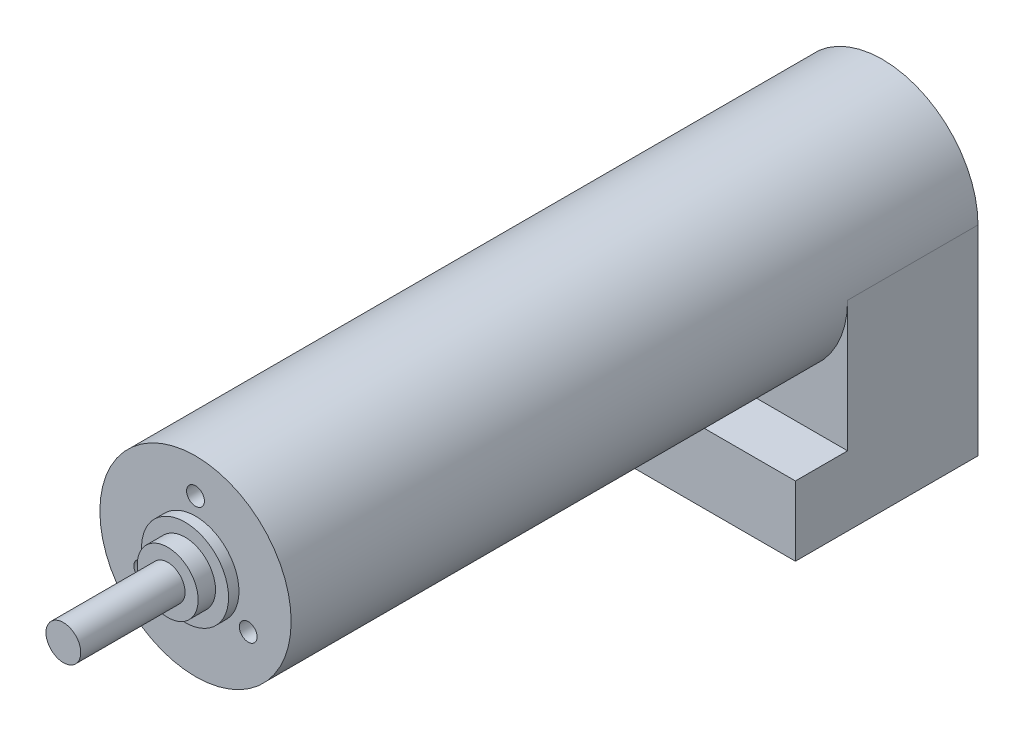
ISO-10303-21;
HEADER;
FILE_DESCRIPTION(('STEP AP214'),'2;1');
FILE_NAME('part.step','',(''),(''),'','','');
FILE_SCHEMA(('AUTOMOTIVE_DESIGN { 1 0 10303 214 1 1 1 1 }'));
ENDSEC;
DATA;
#1=APPLICATION_CONTEXT('core data for automotive mechanical design processes');
#2=APPLICATION_PROTOCOL_DEFINITION('international standard','automotive_design',2000,#1);
#3=PRODUCT_CONTEXT('',#1,'mechanical');
#4=PRODUCT('Part','Part','',(#3));
#5=PRODUCT_RELATED_PRODUCT_CATEGORY('part','',(#4));
#6=PRODUCT_DEFINITION_FORMATION('','',#4);
#7=PRODUCT_DEFINITION_CONTEXT('part definition',#1,'design');
#8=PRODUCT_DEFINITION('design','',#6,#7);
#9=PRODUCT_DEFINITION_SHAPE('','',#8);
#10=(LENGTH_UNIT() NAMED_UNIT(*) SI_UNIT(.MILLI.,.METRE.));
#11=(NAMED_UNIT(*) PLANE_ANGLE_UNIT() SI_UNIT($,.RADIAN.));
#12=(NAMED_UNIT(*) SI_UNIT($,.STERADIAN.) SOLID_ANGLE_UNIT());
#13=UNCERTAINTY_MEASURE_WITH_UNIT(LENGTH_MEASURE(1.E-05),#10,'distance_accuracy_value','');
#14=(GEOMETRIC_REPRESENTATION_CONTEXT(3) GLOBAL_UNCERTAINTY_ASSIGNED_CONTEXT((#13)) GLOBAL_UNIT_ASSIGNED_CONTEXT((#10,
#11,#12)) REPRESENTATION_CONTEXT('',''));
#15=CARTESIAN_POINT('',(0.,0.,0.));
#16=DIRECTION('',(0.,0.,1.));
#17=DIRECTION('',(1.,0.,0.));
#18=AXIS2_PLACEMENT_3D('',#15,#16,#17);
#19=CARTESIAN_POINT('',(0.,0.,64.));
#20=DIRECTION('',(0.,0.,-1.));
#21=DIRECTION('',(-1.,0.,0.));
#22=AXIS2_PLACEMENT_3D('',#19,#20,#21);
#23=CYLINDRICAL_SURFACE('',#22,11.);
#24=CARTESIAN_POINT('',(0.,0.,64.));
#25=DIRECTION('',(0.,0.,1.));
#26=DIRECTION('',(1.,0.,0.));
#27=AXIS2_PLACEMENT_3D('',#24,#25,#26);
#28=CIRCLE('',#27,11.);
#29=CARTESIAN_POINT('',(11.,0.,64.));
#30=VERTEX_POINT('',#29);
#31=EDGE_CURVE('E45',#30,#30,#28,.T.);
#32=ORIENTED_EDGE('',*,*,#31,.F.);
#33=EDGE_LOOP('',(#32));
#34=FACE_BOUND('',#33,.T.);
#35=CARTESIAN_POINT('',(0.,0.,0.));
#36=DIRECTION('',(0.,0.,1.));
#37=DIRECTION('',(1.,0.,0.));
#38=AXIS2_PLACEMENT_3D('',#35,#36,#37);
#39=CIRCLE('',#38,11.);
#40=CARTESIAN_POINT('',(-11.,0.,0.));
#41=VERTEX_POINT('',#40);
#42=CARTESIAN_POINT('',(11.,0.,0.));
#43=VERTEX_POINT('',#42);
#44=EDGE_CURVE('E123',#41,#43,#39,.T.);
#45=ORIENTED_EDGE('',*,*,#44,.T.);
#46=DIRECTION('',(0.,0.,1.));
#47=VECTOR('',#46,1.);
#48=CARTESIAN_POINT('',(11.,0.,-15.));
#49=LINE('',#48,#47);
#50=CARTESIAN_POINT('',(11.,0.,-15.));
#51=VERTEX_POINT('',#50);
#52=EDGE_CURVE('E52',#51,#43,#49,.T.);
#53=ORIENTED_EDGE('',*,*,#52,.F.);
#54=CARTESIAN_POINT('',(0.,0.,-15.));
#55=DIRECTION('',(0.,0.,-1.));
#56=DIRECTION('',(-1.,0.,0.));
#57=AXIS2_PLACEMENT_3D('',#54,#55,#56);
#58=CIRCLE('',#57,11.);
#59=CARTESIAN_POINT('',(-11.,0.,-15.));
#60=VERTEX_POINT('',#59);
#61=EDGE_CURVE('E95',#60,#51,#58,.T.);
#62=ORIENTED_EDGE('',*,*,#61,.F.);
#63=DIRECTION('',(0.,0.,1.));
#64=VECTOR('',#63,1.);
#65=CARTESIAN_POINT('',(-11.,0.,-15.));
#66=LINE('',#65,#64);
#67=EDGE_CURVE('E112',#60,#41,#66,.T.);
#68=ORIENTED_EDGE('',*,*,#67,.T.);
#69=EDGE_LOOP('',(#45,#53,#62,#68));
#70=FACE_BOUND('',#69,.T.);
#71=ADVANCED_FACE('F38',(#34,#70),#23,.T.);
#72=CARTESIAN_POINT('',(0.,0.,64.));
#73=DIRECTION('',(0.,0.,1.));
#74=DIRECTION('',(1.,0.,0.));
#75=AXIS2_PLACEMENT_3D('',#72,#73,#74);
#76=PLANE('',#75);
#77=CARTESIAN_POINT('',(0.,0.,64.));
#78=DIRECTION('',(0.,0.,1.));
#79=DIRECTION('',(1.,0.,0.));
#80=AXIS2_PLACEMENT_3D('',#77,#78,#79);
#81=CIRCLE('',#80,5.);
#82=CARTESIAN_POINT('',(5.,0.,64.));
#83=VERTEX_POINT('',#82);
#84=EDGE_CURVE('E167',#83,#83,#81,.T.);
#85=ORIENTED_EDGE('',*,*,#84,.F.);
#86=EDGE_LOOP('',(#85));
#87=FACE_BOUND('',#86,.T.);
#88=CARTESIAN_POINT('',(0.,7.,64.));
#89=DIRECTION('',(0.,0.,1.));
#90=DIRECTION('',(1.,0.,0.));
#91=AXIS2_PLACEMENT_3D('',#88,#89,#90);
#92=CIRCLE('',#91,1.025);
#93=CARTESIAN_POINT('',(1.025,7.,64.));
#94=VERTEX_POINT('',#93);
#95=EDGE_CURVE('E163',#94,#94,#92,.T.);
#96=ORIENTED_EDGE('',*,*,#95,.F.);
#97=EDGE_LOOP('',(#96));
#98=FACE_BOUND('',#97,.T.);
#99=CARTESIAN_POINT('',(6.06217782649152,-3.49999999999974,64.));
#100=DIRECTION('',(0.,0.,1.));
#101=DIRECTION('',(1.,0.,0.));
#102=AXIS2_PLACEMENT_3D('',#99,#100,#101);
#103=CIRCLE('',#102,1.025);
#104=CARTESIAN_POINT('',(7.08717782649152,-3.49999999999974,64.));
#105=VERTEX_POINT('',#104);
#106=EDGE_CURVE('E157',#105,#105,#103,.T.);
#107=ORIENTED_EDGE('',*,*,#106,.F.);
#108=EDGE_LOOP('',(#107));
#109=FACE_BOUND('',#108,.T.);
#110=CARTESIAN_POINT('',(-6.06217782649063,-3.50000000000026,64.));
#111=DIRECTION('',(0.,0.,1.));
#112=DIRECTION('',(1.,0.,0.));
#113=AXIS2_PLACEMENT_3D('',#110,#111,#112);
#114=CIRCLE('',#113,1.025);
#115=CARTESIAN_POINT('',(-5.03717782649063,-3.50000000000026,64.));
#116=VERTEX_POINT('',#115);
#117=EDGE_CURVE('E151',#116,#116,#114,.T.);
#118=ORIENTED_EDGE('',*,*,#117,.F.);
#119=EDGE_LOOP('',(#118));
#120=FACE_BOUND('',#119,.T.);
#121=ORIENTED_EDGE('',*,*,#31,.T.);
#122=EDGE_LOOP('',(#121));
#123=FACE_BOUND('',#122,.T.);
#124=ADVANCED_FACE('F218',(#87,#98,#109,#120,#123),#76,.T.);
#125=CARTESIAN_POINT('',(11.,0.,-15.));
#126=DIRECTION('',(-1.,0.,0.));
#127=DIRECTION('',(0.,0.,1.));
#128=AXIS2_PLACEMENT_3D('',#125,#126,#127);
#129=PLANE('',#128);
#130=DIRECTION('',(0.,-1.,0.));
#131=VECTOR('',#130,1.);
#132=CARTESIAN_POINT('',(11.,0.,0.));
#133=LINE('',#132,#131);
#134=CARTESIAN_POINT('',(11.,-15.,0.));
#135=VERTEX_POINT('',#134);
#136=EDGE_CURVE('E116',#43,#135,#133,.T.);
#137=ORIENTED_EDGE('',*,*,#136,.T.);
#138=DIRECTION('',(0.,0.,-1.));
#139=VECTOR('',#138,1.);
#140=CARTESIAN_POINT('',(11.,-15.,6.));
#141=LINE('',#140,#139);
#142=CARTESIAN_POINT('',(11.,-15.,6.));
#143=VERTEX_POINT('',#142);
#144=EDGE_CURVE('E83',#143,#135,#141,.T.);
#145=ORIENTED_EDGE('',*,*,#144,.F.);
#146=DIRECTION('',(0.,-1.,0.));
#147=VECTOR('',#146,1.);
#148=CARTESIAN_POINT('',(11.,-23.,6.));
#149=LINE('',#148,#147);
#150=CARTESIAN_POINT('',(11.,-23.,6.));
#151=VERTEX_POINT('',#150);
#152=EDGE_CURVE('E103',#143,#151,#149,.T.);
#153=ORIENTED_EDGE('',*,*,#152,.T.);
#154=DIRECTION('',(0.,0.,1.));
#155=VECTOR('',#154,1.);
#156=CARTESIAN_POINT('',(11.,-23.,-15.));
#157=LINE('',#156,#155);
#158=CARTESIAN_POINT('',(11.,-23.,-15.));
#159=VERTEX_POINT('',#158);
#160=EDGE_CURVE('E99',#159,#151,#157,.T.);
#161=ORIENTED_EDGE('',*,*,#160,.F.);
#162=DIRECTION('',(0.,-1.,0.));
#163=VECTOR('',#162,1.);
#164=CARTESIAN_POINT('',(11.,0.,-15.));
#165=LINE('',#164,#163);
#166=EDGE_CURVE('E88',#51,#159,#165,.T.);
#167=ORIENTED_EDGE('',*,*,#166,.F.);
#168=ORIENTED_EDGE('',*,*,#52,.T.);
#169=EDGE_LOOP('',(#137,#145,#153,#161,#167,#168));
#170=FACE_BOUND('',#169,.T.);
#171=ADVANCED_FACE('F100',(#170),#129,.F.);
#172=CARTESIAN_POINT('',(11.,-23.,-15.));
#173=DIRECTION('',(0.,1.,0.));
#174=DIRECTION('',(0.,0.,1.));
#175=AXIS2_PLACEMENT_3D('',#172,#173,#174);
#176=PLANE('',#175);
#177=ORIENTED_EDGE('',*,*,#160,.T.);
#178=DIRECTION('',(-1.,0.,0.));
#179=VECTOR('',#178,1.);
#180=CARTESIAN_POINT('',(11.,-23.,6.));
#181=LINE('',#180,#179);
#182=CARTESIAN_POINT('',(-11.,-23.,6.));
#183=VERTEX_POINT('',#182);
#184=EDGE_CURVE('E137',#151,#183,#181,.T.);
#185=ORIENTED_EDGE('',*,*,#184,.T.);
#186=DIRECTION('',(0.,0.,1.));
#187=VECTOR('',#186,1.);
#188=CARTESIAN_POINT('',(-11.,-23.,-15.));
#189=LINE('',#188,#187);
#190=CARTESIAN_POINT('',(-11.,-23.,-15.));
#191=VERTEX_POINT('',#190);
#192=EDGE_CURVE('E107',#191,#183,#189,.T.);
#193=ORIENTED_EDGE('',*,*,#192,.F.);
#194=DIRECTION('',(-1.,0.,0.));
#195=VECTOR('',#194,1.);
#196=CARTESIAN_POINT('',(11.,-23.,-15.));
#197=LINE('',#196,#195);
#198=EDGE_CURVE('E92',#159,#191,#197,.T.);
#199=ORIENTED_EDGE('',*,*,#198,.F.);
#200=EDGE_LOOP('',(#177,#185,#193,#199));
#201=FACE_BOUND('',#200,.T.);
#202=ADVANCED_FACE('F109',(#201),#176,.F.);
#203=CARTESIAN_POINT('',(-11.,-23.,-15.));
#204=DIRECTION('',(1.,0.,0.));
#205=DIRECTION('',(0.,0.,-1.));
#206=AXIS2_PLACEMENT_3D('',#203,#204,#205);
#207=PLANE('',#206);
#208=ORIENTED_EDGE('',*,*,#67,.F.);
#209=DIRECTION('',(0.,1.,0.));
#210=VECTOR('',#209,1.);
#211=CARTESIAN_POINT('',(-11.,-23.,-15.));
#212=LINE('',#211,#210);
#213=EDGE_CURVE('E61',#191,#60,#212,.T.);
#214=ORIENTED_EDGE('',*,*,#213,.F.);
#215=ORIENTED_EDGE('',*,*,#192,.T.);
#216=DIRECTION('',(0.,1.,0.));
#217=VECTOR('',#216,1.);
#218=CARTESIAN_POINT('',(-11.,-23.,6.));
#219=LINE('',#218,#217);
#220=CARTESIAN_POINT('',(-11.,-15.,6.));
#221=VERTEX_POINT('',#220);
#222=EDGE_CURVE('E143',#183,#221,#219,.T.);
#223=ORIENTED_EDGE('',*,*,#222,.T.);
#224=DIRECTION('',(0.,0.,-1.));
#225=VECTOR('',#224,1.);
#226=CARTESIAN_POINT('',(-11.,-15.,6.));
#227=LINE('',#226,#225);
#228=CARTESIAN_POINT('',(-11.,-15.,0.));
#229=VERTEX_POINT('',#228);
#230=EDGE_CURVE('E130',#221,#229,#227,.T.);
#231=ORIENTED_EDGE('',*,*,#230,.T.);
#232=DIRECTION('',(0.,1.,0.));
#233=VECTOR('',#232,1.);
#234=CARTESIAN_POINT('',(-11.,-23.,0.));
#235=LINE('',#234,#233);
#236=EDGE_CURVE('E73',#229,#41,#235,.T.);
#237=ORIENTED_EDGE('',*,*,#236,.T.);
#238=EDGE_LOOP('',(#208,#214,#215,#223,#231,#237));
#239=FACE_BOUND('',#238,.T.);
#240=ADVANCED_FACE('F250',(#239),#207,.F.);
#241=CARTESIAN_POINT('',(0.,0.,-15.));
#242=DIRECTION('',(0.,0.,-1.));
#243=DIRECTION('',(-1.,0.,0.));
#244=AXIS2_PLACEMENT_3D('',#241,#242,#243);
#245=PLANE('',#244);
#246=CARTESIAN_POINT('',(0.,7.,-15.));
#247=DIRECTION('',(0.,0.,1.));
#248=DIRECTION('',(1.,0.,0.));
#249=AXIS2_PLACEMENT_3D('',#246,#247,#248);
#250=CIRCLE('',#249,1.02499999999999);
#251=CARTESIAN_POINT('',(1.02499999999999,7.,-15.));
#252=VERTEX_POINT('',#251);
#253=EDGE_CURVE('E160',#252,#252,#250,.T.);
#254=ORIENTED_EDGE('',*,*,#253,.T.);
#255=EDGE_LOOP('',(#254));
#256=FACE_BOUND('',#255,.T.);
#257=CARTESIAN_POINT('',(6.06217782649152,-3.49999999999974,-15.));
#258=DIRECTION('',(0.,0.,1.));
#259=DIRECTION('',(1.,0.,0.));
#260=AXIS2_PLACEMENT_3D('',#257,#258,#259);
#261=CIRCLE('',#260,1.02499999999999);
#262=CARTESIAN_POINT('',(7.08717782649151,-3.49999999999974,-15.));
#263=VERTEX_POINT('',#262);
#264=EDGE_CURVE('E154',#263,#263,#261,.T.);
#265=ORIENTED_EDGE('',*,*,#264,.T.);
#266=EDGE_LOOP('',(#265));
#267=FACE_BOUND('',#266,.T.);
#268=CARTESIAN_POINT('',(-6.06217782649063,-3.50000000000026,-15.));
#269=DIRECTION('',(0.,0.,1.));
#270=DIRECTION('',(1.,0.,0.));
#271=AXIS2_PLACEMENT_3D('',#268,#269,#270);
#272=CIRCLE('',#271,1.02499999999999);
#273=CARTESIAN_POINT('',(-5.03717782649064,-3.50000000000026,-15.));
#274=VERTEX_POINT('',#273);
#275=EDGE_CURVE('E138',#274,#274,#272,.T.);
#276=ORIENTED_EDGE('',*,*,#275,.T.);
#277=EDGE_LOOP('',(#276));
#278=FACE_BOUND('',#277,.T.);
#279=ORIENTED_EDGE('',*,*,#166,.T.);
#280=ORIENTED_EDGE('',*,*,#198,.T.);
#281=ORIENTED_EDGE('',*,*,#213,.T.);
#282=ORIENTED_EDGE('',*,*,#61,.T.);
#283=EDGE_LOOP('',(#279,#280,#281,#282));
#284=FACE_BOUND('',#283,.T.);
#285=ADVANCED_FACE('F90',(#256,#267,#278,#284),#245,.T.);
#286=CARTESIAN_POINT('',(0.,0.,0.));
#287=DIRECTION('',(0.,0.,-1.));
#288=DIRECTION('',(-1.,0.,0.));
#289=AXIS2_PLACEMENT_3D('',#286,#287,#288);
#290=PLANE('',#289);
#291=ORIENTED_EDGE('',*,*,#236,.F.);
#292=DIRECTION('',(1.,0.,0.));
#293=VECTOR('',#292,1.);
#294=CARTESIAN_POINT('',(0.,-15.,0.));
#295=LINE('',#294,#293);
#296=EDGE_CURVE('E11',#229,#135,#295,.T.);
#297=ORIENTED_EDGE('',*,*,#296,.T.);
#298=ORIENTED_EDGE('',*,*,#136,.F.);
#299=ORIENTED_EDGE('',*,*,#44,.F.);
#300=EDGE_LOOP('',(#291,#297,#298,#299));
#301=FACE_BOUND('',#300,.T.);
#302=ADVANCED_FACE('F128',(#301),#290,.F.);
#303=CARTESIAN_POINT('',(11.,-15.,6.));
#304=DIRECTION('',(0.,1.,0.));
#305=DIRECTION('',(0.,0.,1.));
#306=AXIS2_PLACEMENT_3D('',#303,#304,#305);
#307=PLANE('',#306);
#308=ORIENTED_EDGE('',*,*,#296,.F.);
#309=ORIENTED_EDGE('',*,*,#230,.F.);
#310=DIRECTION('',(1.,0.,0.));
#311=VECTOR('',#310,1.);
#312=CARTESIAN_POINT('',(11.,-15.,6.));
#313=LINE('',#312,#311);
#314=EDGE_CURVE('E136',#221,#143,#313,.T.);
#315=ORIENTED_EDGE('',*,*,#314,.T.);
#316=ORIENTED_EDGE('',*,*,#144,.T.);
#317=EDGE_LOOP('',(#308,#309,#315,#316));
#318=FACE_BOUND('',#317,.T.);
#319=ADVANCED_FACE('F141',(#318),#307,.T.);
#320=CARTESIAN_POINT('',(0.,0.,6.));
#321=DIRECTION('',(0.,0.,1.));
#322=DIRECTION('',(1.,0.,0.));
#323=AXIS2_PLACEMENT_3D('',#320,#321,#322);
#324=PLANE('',#323);
#325=ORIENTED_EDGE('',*,*,#152,.F.);
#326=ORIENTED_EDGE('',*,*,#314,.F.);
#327=ORIENTED_EDGE('',*,*,#222,.F.);
#328=ORIENTED_EDGE('',*,*,#184,.F.);
#329=EDGE_LOOP('',(#325,#326,#327,#328));
#330=FACE_BOUND('',#329,.T.);
#331=ADVANCED_FACE('F134',(#330),#324,.T.);
#332=CARTESIAN_POINT('',(-6.06217782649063,-3.50000000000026,64.));
#333=DIRECTION('',(0.,0.,1.));
#334=DIRECTION('',(1.,0.,0.));
#335=AXIS2_PLACEMENT_3D('',#332,#333,#334);
#336=CYLINDRICAL_SURFACE('',#335,1.02499999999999);
#337=ORIENTED_EDGE('',*,*,#275,.F.);
#338=EDGE_LOOP('',(#337));
#339=FACE_BOUND('',#338,.T.);
#340=ORIENTED_EDGE('',*,*,#117,.T.);
#341=EDGE_LOOP('',(#340));
#342=FACE_BOUND('',#341,.T.);
#343=ADVANCED_FACE('F283',(#339,#342),#336,.F.);
#344=CARTESIAN_POINT('',(6.06217782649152,-3.49999999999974,64.));
#345=DIRECTION('',(0.,0.,1.));
#346=DIRECTION('',(1.,0.,0.));
#347=AXIS2_PLACEMENT_3D('',#344,#345,#346);
#348=CYLINDRICAL_SURFACE('',#347,1.02499999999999);
#349=ORIENTED_EDGE('',*,*,#264,.F.);
#350=EDGE_LOOP('',(#349));
#351=FACE_BOUND('',#350,.T.);
#352=ORIENTED_EDGE('',*,*,#106,.T.);
#353=EDGE_LOOP('',(#352));
#354=FACE_BOUND('',#353,.T.);
#355=ADVANCED_FACE('F290',(#351,#354),#348,.F.);
#356=CARTESIAN_POINT('',(0.,7.,64.));
#357=DIRECTION('',(0.,0.,1.));
#358=DIRECTION('',(1.,0.,0.));
#359=AXIS2_PLACEMENT_3D('',#356,#357,#358);
#360=CYLINDRICAL_SURFACE('',#359,1.02499999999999);
#361=ORIENTED_EDGE('',*,*,#253,.F.);
#362=EDGE_LOOP('',(#361));
#363=FACE_BOUND('',#362,.T.);
#364=ORIENTED_EDGE('',*,*,#95,.T.);
#365=EDGE_LOOP('',(#364));
#366=FACE_BOUND('',#365,.T.);
#367=ADVANCED_FACE('F214',(#363,#366),#360,.F.);
#368=CARTESIAN_POINT('',(0.,0.,65.2));
#369=DIRECTION('',(0.,0.,-1.));
#370=DIRECTION('',(-1.,0.,0.));
#371=AXIS2_PLACEMENT_3D('',#368,#369,#370);
#372=CYLINDRICAL_SURFACE('',#371,5.);
#373=CARTESIAN_POINT('',(0.,0.,65.2));
#374=DIRECTION('',(0.,0.,1.));
#375=DIRECTION('',(1.,0.,0.));
#376=AXIS2_PLACEMENT_3D('',#373,#374,#375);
#377=CIRCLE('',#376,5.);
#378=CARTESIAN_POINT('',(5.,0.,65.2));
#379=VERTEX_POINT('',#378);
#380=EDGE_CURVE('E166',#379,#379,#377,.T.);
#381=ORIENTED_EDGE('',*,*,#380,.F.);
#382=EDGE_LOOP('',(#381));
#383=FACE_BOUND('',#382,.T.);
#384=ORIENTED_EDGE('',*,*,#84,.T.);
#385=EDGE_LOOP('',(#384));
#386=FACE_BOUND('',#385,.T.);
#387=ADVANCED_FACE('F208',(#383,#386),#372,.T.);
#388=CARTESIAN_POINT('',(0.,0.,65.2));
#389=DIRECTION('',(0.,0.,1.));
#390=DIRECTION('',(1.,0.,0.));
#391=AXIS2_PLACEMENT_3D('',#388,#389,#390);
#392=PLANE('',#391);
#393=CARTESIAN_POINT('',(0.,0.,65.2));
#394=DIRECTION('',(0.,0.,1.));
#395=DIRECTION('',(1.,0.,0.));
#396=AXIS2_PLACEMENT_3D('',#393,#394,#395);
#397=CIRCLE('',#396,3.5);
#398=CARTESIAN_POINT('',(3.5,0.,65.2));
#399=VERTEX_POINT('',#398);
#400=EDGE_CURVE('E173',#399,#399,#397,.T.);
#401=ORIENTED_EDGE('',*,*,#400,.F.);
#402=EDGE_LOOP('',(#401));
#403=FACE_BOUND('',#402,.T.);
#404=ORIENTED_EDGE('',*,*,#380,.T.);
#405=EDGE_LOOP('',(#404));
#406=FACE_BOUND('',#405,.T.);
#407=ADVANCED_FACE('F202',(#403,#406),#392,.T.);
#408=CARTESIAN_POINT('',(0.,0.,67.2));
#409=DIRECTION('',(0.,0.,-1.));
#410=DIRECTION('',(-1.,0.,0.));
#411=AXIS2_PLACEMENT_3D('',#408,#409,#410);
#412=CYLINDRICAL_SURFACE('',#411,3.5);
#413=CARTESIAN_POINT('',(0.,0.,67.2));
#414=DIRECTION('',(0.,0.,1.));
#415=DIRECTION('',(1.,0.,0.));
#416=AXIS2_PLACEMENT_3D('',#413,#414,#415);
#417=CIRCLE('',#416,3.5);
#418=CARTESIAN_POINT('',(3.5,0.,67.2));
#419=VERTEX_POINT('',#418);
#420=EDGE_CURVE('E170',#419,#419,#417,.T.);
#421=ORIENTED_EDGE('',*,*,#420,.F.);
#422=EDGE_LOOP('',(#421));
#423=FACE_BOUND('',#422,.T.);
#424=ORIENTED_EDGE('',*,*,#400,.T.);
#425=EDGE_LOOP('',(#424));
#426=FACE_BOUND('',#425,.T.);
#427=ADVANCED_FACE('F196',(#423,#426),#412,.T.);
#428=CARTESIAN_POINT('',(0.,0.,67.2));
#429=DIRECTION('',(0.,0.,1.));
#430=DIRECTION('',(1.,0.,0.));
#431=AXIS2_PLACEMENT_3D('',#428,#429,#430);
#432=PLANE('',#431);
#433=CARTESIAN_POINT('',(0.,0.,67.2));
#434=DIRECTION('',(0.,0.,1.));
#435=DIRECTION('',(1.,0.,0.));
#436=AXIS2_PLACEMENT_3D('',#433,#434,#435);
#437=CIRCLE('',#436,2.);
#438=CARTESIAN_POINT('',(2.,0.,67.2));
#439=VERTEX_POINT('',#438);
#440=EDGE_CURVE('E179',#439,#439,#437,.T.);
#441=ORIENTED_EDGE('',*,*,#440,.F.);
#442=EDGE_LOOP('',(#441));
#443=FACE_BOUND('',#442,.T.);
#444=ORIENTED_EDGE('',*,*,#420,.T.);
#445=EDGE_LOOP('',(#444));
#446=FACE_BOUND('',#445,.T.);
#447=ADVANCED_FACE('F190',(#443,#446),#432,.T.);
#448=CARTESIAN_POINT('',(0.,0.,79.2));
#449=DIRECTION('',(0.,0.,-1.));
#450=DIRECTION('',(-1.,0.,0.));
#451=AXIS2_PLACEMENT_3D('',#448,#449,#450);
#452=CYLINDRICAL_SURFACE('',#451,2.);
#453=CARTESIAN_POINT('',(0.,0.,79.2));
#454=DIRECTION('',(0.,0.,1.));
#455=DIRECTION('',(1.,0.,0.));
#456=AXIS2_PLACEMENT_3D('',#453,#454,#455);
#457=CIRCLE('',#456,2.);
#458=CARTESIAN_POINT('',(2.,0.,79.2));
#459=VERTEX_POINT('',#458);
#460=EDGE_CURVE('E176',#459,#459,#457,.T.);
#461=ORIENTED_EDGE('',*,*,#460,.F.);
#462=EDGE_LOOP('',(#461));
#463=FACE_BOUND('',#462,.T.);
#464=ORIENTED_EDGE('',*,*,#440,.T.);
#465=EDGE_LOOP('',(#464));
#466=FACE_BOUND('',#465,.T.);
#467=ADVANCED_FACE('F187',(#463,#466),#452,.T.);
#468=CARTESIAN_POINT('',(0.,0.,79.2));
#469=DIRECTION('',(0.,0.,1.));
#470=DIRECTION('',(1.,0.,0.));
#471=AXIS2_PLACEMENT_3D('',#468,#469,#470);
#472=PLANE('',#471);
#473=ORIENTED_EDGE('',*,*,#460,.T.);
#474=EDGE_LOOP('',(#473));
#475=FACE_BOUND('',#474,.T.);
#476=ADVANCED_FACE('F185',(#475),#472,.T.);
#477=CLOSED_SHELL('',(#71,#124,#171,#202,#240,#285,#302,#319,#331,#343,#355,#367,#387,#407,#427,
#447,#467,#476));
#478=MANIFOLD_SOLID_BREP('B2',#477);
#479=ADVANCED_BREP_SHAPE_REPRESENTATION('',(#18,#478),#14);
#480=SHAPE_DEFINITION_REPRESENTATION(#9,#479);
ENDSEC;
END-ISO-10303-21;
